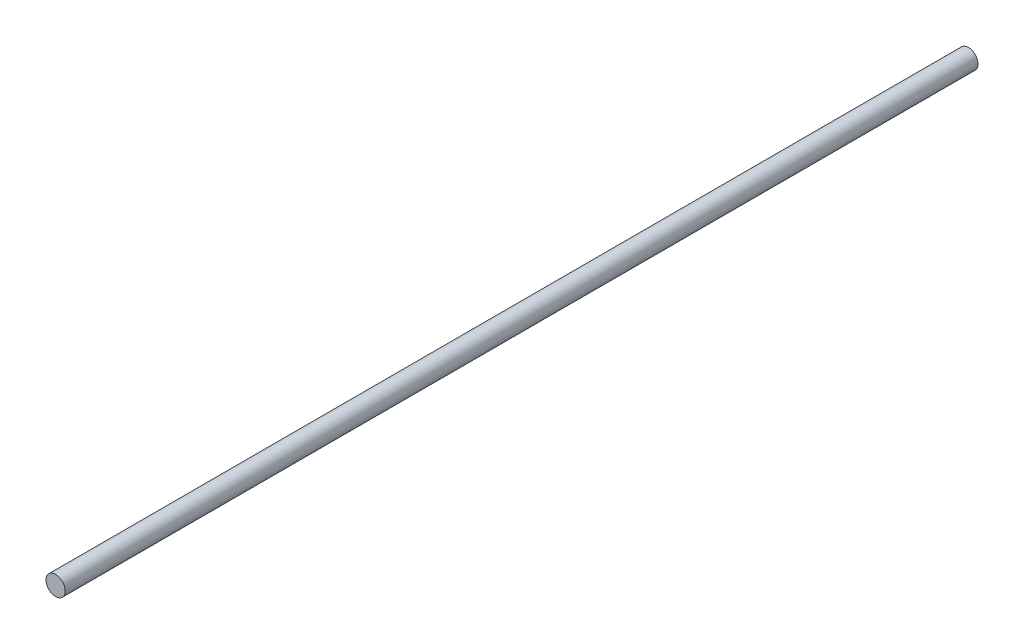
from build123d import *

# Parameters (mm, degrees)
SKETCH1_R           = 30
BOSS_EXTRUDE1_DEPTH = 2850


with BuildPart() as part:
    # Sketch1 → Boss-Extrude1 (new body)
    with BuildSketch(Plane.XY):
        Circle(SKETCH1_R)
    extrude(amount=-BOSS_EXTRUDE1_DEPTH)


solid = part.part
